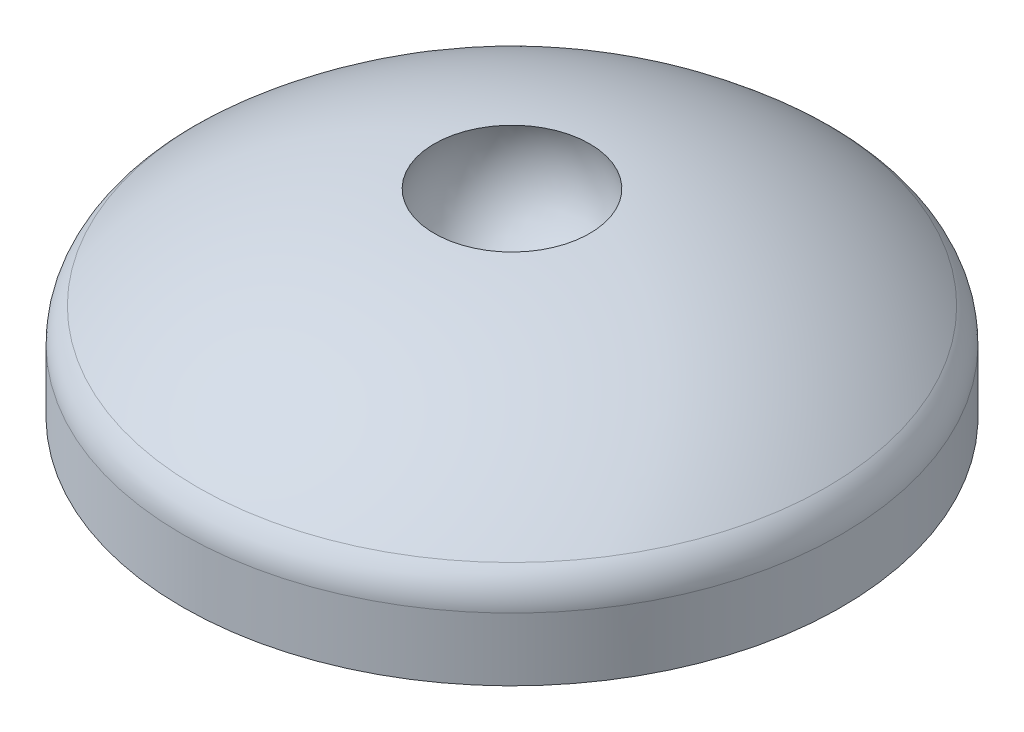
ISO-10303-21;
HEADER;
FILE_DESCRIPTION(('STEP AP214'),'2;1');
FILE_NAME('part.step','',(''),(''),'','','');
FILE_SCHEMA(('AUTOMOTIVE_DESIGN { 1 0 10303 214 1 1 1 1 }'));
ENDSEC;
DATA;
#1=APPLICATION_CONTEXT('core data for automotive mechanical design processes');
#2=APPLICATION_PROTOCOL_DEFINITION('international standard','automotive_design',2000,#1);
#3=PRODUCT_CONTEXT('',#1,'mechanical');
#4=PRODUCT('Part','Part','',(#3));
#5=PRODUCT_RELATED_PRODUCT_CATEGORY('part','',(#4));
#6=PRODUCT_DEFINITION_FORMATION('','',#4);
#7=PRODUCT_DEFINITION_CONTEXT('part definition',#1,'design');
#8=PRODUCT_DEFINITION('design','',#6,#7);
#9=PRODUCT_DEFINITION_SHAPE('','',#8);
#10=(LENGTH_UNIT() NAMED_UNIT(*) SI_UNIT(.MILLI.,.METRE.));
#11=(NAMED_UNIT(*) PLANE_ANGLE_UNIT() SI_UNIT($,.RADIAN.));
#12=(NAMED_UNIT(*) SI_UNIT($,.STERADIAN.) SOLID_ANGLE_UNIT());
#13=UNCERTAINTY_MEASURE_WITH_UNIT(LENGTH_MEASURE(1.E-05),#10,'distance_accuracy_value','');
#14=(GEOMETRIC_REPRESENTATION_CONTEXT(3) GLOBAL_UNCERTAINTY_ASSIGNED_CONTEXT((#13)) GLOBAL_UNIT_ASSIGNED_CONTEXT((#10,
#11,#12)) REPRESENTATION_CONTEXT('',''));
#15=CARTESIAN_POINT('',(0.,0.,0.));
#16=DIRECTION('',(0.,0.,1.));
#17=DIRECTION('',(1.,0.,0.));
#18=AXIS2_PLACEMENT_3D('',#15,#16,#17);
#19=CARTESIAN_POINT('',(0.,15.5,0.));
#20=DIRECTION('',(-1.,0.,0.));
#21=DIRECTION('',(0.,0.,-1.));
#22=AXIS2_PLACEMENT_3D('',#19,#20,#21);
#23=SPHERICAL_SURFACE('',#22,7.5);
#24=CARTESIAN_POINT('',(0.,15.5,0.));
#25=DIRECTION('',(0.,-1.,0.));
#26=DIRECTION('',(0.,0.,-1.));
#27=AXIS2_PLACEMENT_3D('',#24,#25,#26);
#28=SPHERICAL_SURFACE('',#27,7.5);
#29=CARTESIAN_POINT('',(0.,17.9931801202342,0.));
#30=DIRECTION('',(0.,-1.,0.));
#31=DIRECTION('',(0.,0.,-1.));
#32=AXIS2_PLACEMENT_3D('',#29,#30,#31);
#33=CIRCLE('',#32,7.07347530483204);
#34=CARTESIAN_POINT('',(0.,17.9931801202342,-7.07347530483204));
#35=VERTEX_POINT('',#34);
#36=EDGE_CURVE('E18',#35,#35,#33,.T.);
#37=ORIENTED_EDGE('',*,*,#36,.F.);
#38=EDGE_LOOP('',(#37));
#39=FACE_BOUND('',#38,.T.);
#40=ADVANCED_FACE('F14',(#39),#28,.F.);
#41=CARTESIAN_POINT('',(0.,-20.1071428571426,-3.50000000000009));
#42=DIRECTION('',(1.,0.,0.));
#43=DIRECTION('',(0.,0.,-1.));
#44=AXIS2_PLACEMENT_3D('',#41,#42,#43);
#45=CIRCLE('',#44,38.2675363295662);
#46=TRIMMED_CURVE('',#45,(PARAMETER_VALUE(-1.66238566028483)),
(PARAMETER_VALUE(1.66238566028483)),.T.,.PARAMETER.);
#47=CARTESIAN_POINT('',(0.,-20.1071428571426,0.));
#48=DIRECTION('',(0.,-1.,0.));
#49=AXIS1_PLACEMENT('',#47,#48);
#50=SURFACE_OF_REVOLUTION('',#46,#49);
#51=CARTESIAN_POINT('',(0.,8.75578730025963,0.));
#52=DIRECTION('',(0.,-1.,0.));
#53=DIRECTION('',(1.,0.,0.));
#54=AXIS2_PLACEMENT_3D('',#51,#52,#53);
#55=CIRCLE('',#54,28.6263924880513);
#56=CARTESIAN_POINT('',(28.6263924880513,8.75578730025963,0.));
#57=VERTEX_POINT('',#56);
#58=EDGE_CURVE('E30',#57,#57,#55,.T.);
#59=ORIENTED_EDGE('',*,*,#58,.F.);
#60=EDGE_LOOP('',(#59));
#61=FACE_BOUND('',#60,.T.);
#62=ORIENTED_EDGE('',*,*,#36,.T.);
#63=EDGE_LOOP('',(#62));
#64=FACE_BOUND('',#63,.T.);
#65=ADVANCED_FACE('F43',(#61,#64),#50,.F.);
#66=CARTESIAN_POINT('',(0.,5.73882483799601,0.));
#67=DIRECTION('',(0.,-1.,0.));
#68=DIRECTION('',(1.,0.,0.));
#69=AXIS2_PLACEMENT_3D('',#66,#67,#68);
#70=TOROIDAL_SURFACE('',#69,26.,4.00000000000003);
#71=CARTESIAN_POINT('',(0.,5.73882483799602,0.));
#72=DIRECTION('',(0.,1.,0.));
#73=DIRECTION('',(0.,0.,1.));
#74=AXIS2_PLACEMENT_3D('',#71,#72,#73);
#75=CIRCLE('',#74,30.);
#76=CARTESIAN_POINT('',(0.,5.73882483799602,30.));
#77=VERTEX_POINT('',#76);
#78=EDGE_CURVE('E33',#77,#77,#75,.F.);
#79=ORIENTED_EDGE('',*,*,#78,.F.);
#80=EDGE_LOOP('',(#79));
#81=FACE_BOUND('',#80,.T.);
#82=ORIENTED_EDGE('',*,*,#58,.T.);
#83=EDGE_LOOP('',(#82));
#84=FACE_BOUND('',#83,.T.);
#85=ADVANCED_FACE('F16',(#81,#84),#70,.T.);
#86=CARTESIAN_POINT('',(0.,-2.,0.));
#87=DIRECTION('',(0.,1.,0.));
#88=DIRECTION('',(0.,0.,1.));
#89=AXIS2_PLACEMENT_3D('',#86,#87,#88);
#90=CYLINDRICAL_SURFACE('',#89,30.);
#91=ORIENTED_EDGE('',*,*,#78,.T.);
#92=EDGE_LOOP('',(#91));
#93=FACE_BOUND('',#92,.T.);
#94=CARTESIAN_POINT('',(0.,0.,0.));
#95=DIRECTION('',(0.,1.,0.));
#96=DIRECTION('',(0.,0.,1.));
#97=AXIS2_PLACEMENT_3D('',#94,#95,#96);
#98=CIRCLE('',#97,30.);
#99=CARTESIAN_POINT('',(0.,0.,30.));
#100=VERTEX_POINT('',#99);
#101=EDGE_CURVE('E27',#100,#100,#98,.T.);
#102=ORIENTED_EDGE('',*,*,#101,.T.);
#103=EDGE_LOOP('',(#102));
#104=FACE_BOUND('',#103,.T.);
#105=ADVANCED_FACE('F47',(#93,#104),#90,.T.);
#106=CARTESIAN_POINT('',(30.,0.,0.));
#107=DIRECTION('',(0.,1.,0.));
#108=DIRECTION('',(0.,0.,1.));
#109=AXIS2_PLACEMENT_3D('',#106,#107,#108);
#110=PLANE('',#109);
#111=CARTESIAN_POINT('',(0.,0.,0.));
#112=DIRECTION('',(0.,1.,0.));
#113=DIRECTION('',(0.,0.,1.));
#114=AXIS2_PLACEMENT_3D('',#111,#112,#113);
#115=CIRCLE('',#114,26.4);
#116=CARTESIAN_POINT('',(0.,0.,26.4));
#117=VERTEX_POINT('',#116);
#118=EDGE_CURVE('E22',#117,#117,#115,.F.);
#119=ORIENTED_EDGE('',*,*,#118,.F.);
#120=EDGE_LOOP('',(#119));
#121=FACE_BOUND('',#120,.T.);
#122=ORIENTED_EDGE('',*,*,#101,.F.);
#123=EDGE_LOOP('',(#122));
#124=FACE_BOUND('',#123,.T.);
#125=ADVANCED_FACE('F63',(#121,#124),#110,.F.);
#126=CARTESIAN_POINT('',(0.,-2.,0.));
#127=DIRECTION('',(0.,1.,0.));
#128=DIRECTION('',(0.,0.,1.));
#129=AXIS2_PLACEMENT_3D('',#126,#127,#128);
#130=CYLINDRICAL_SURFACE('',#129,26.4);
#131=ORIENTED_EDGE('',*,*,#118,.T.);
#132=EDGE_LOOP('',(#131));
#133=FACE_BOUND('',#132,.T.);
#134=CARTESIAN_POINT('',(0.,-2.,0.));
#135=DIRECTION('',(0.,1.,0.));
#136=DIRECTION('',(0.,0.,1.));
#137=AXIS2_PLACEMENT_3D('',#134,#135,#136);
#138=CIRCLE('',#137,26.4);
#139=CARTESIAN_POINT('',(0.,-2.,26.4));
#140=VERTEX_POINT('',#139);
#141=EDGE_CURVE('E10',#140,#140,#138,.T.);
#142=ORIENTED_EDGE('',*,*,#141,.T.);
#143=EDGE_LOOP('',(#142));
#144=FACE_BOUND('',#143,.T.);
#145=ADVANCED_FACE('F57',(#133,#144),#130,.T.);
#146=CARTESIAN_POINT('',(26.4,-2.,0.));
#147=DIRECTION('',(0.,1.,0.));
#148=DIRECTION('',(0.,0.,1.));
#149=AXIS2_PLACEMENT_3D('',#146,#147,#148);
#150=PLANE('',#149);
#151=ORIENTED_EDGE('',*,*,#141,.F.);
#152=EDGE_LOOP('',(#151));
#153=FACE_BOUND('',#152,.T.);
#154=ADVANCED_FACE('F55',(#153),#150,.F.);
#155=CLOSED_SHELL('',(#40,#65,#85,#105,#125,#145,#154));
#156=MANIFOLD_SOLID_BREP('B1',#155);
#157=ADVANCED_BREP_SHAPE_REPRESENTATION('',(#18,#156),#14);
#158=SHAPE_DEFINITION_REPRESENTATION(#9,#157);
ENDSEC;
END-ISO-10303-21;
